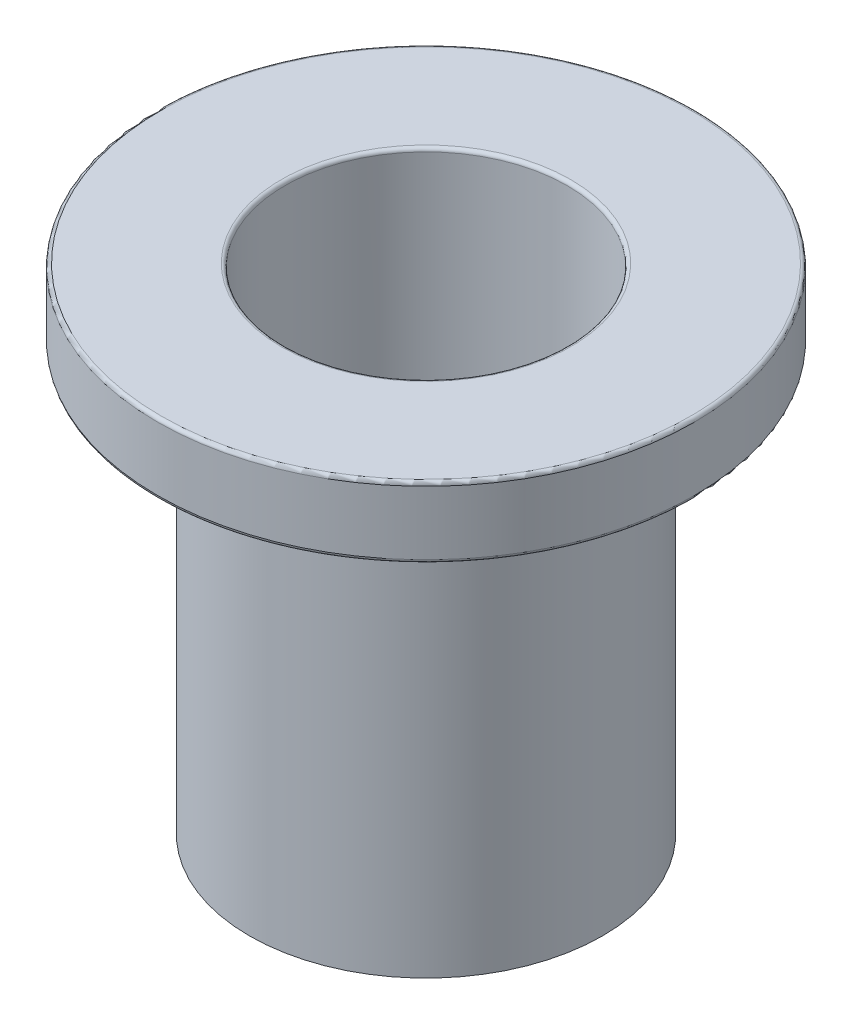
from build123d import *

# Parameters (mm, degrees)
FILLET1_R = 0.0635


with BuildPart() as part:
    # Sketch1 → Revolve1 (revolve)
    with BuildSketch(Plane.XY, mode=Mode.PRIVATE) as revolve1_sk:
        Polygon((2.54, 0), (2.54, 8.89), (4.826, 8.89), (4.826, 7.62), (3.175, 7.62), (3.175, 0), align=None)
    revolve(revolve1_sk.sketch.rotate(Axis((0, 0, 0), (0, 1, 0)), 90), axis=Axis((0, 0, 0), (0, 1, 0)))

    # Fillet1
    fillet1_edges = [part.edges().sort_by_distance(p)[0] for p in [
        (0, 8.89, 2.54),
        (0, 8.89, 4.826),
        (0, 7.62, 4.826),
    ]]
    fillet(fillet1_edges, radius=FILLET1_R)


solid = part.part
